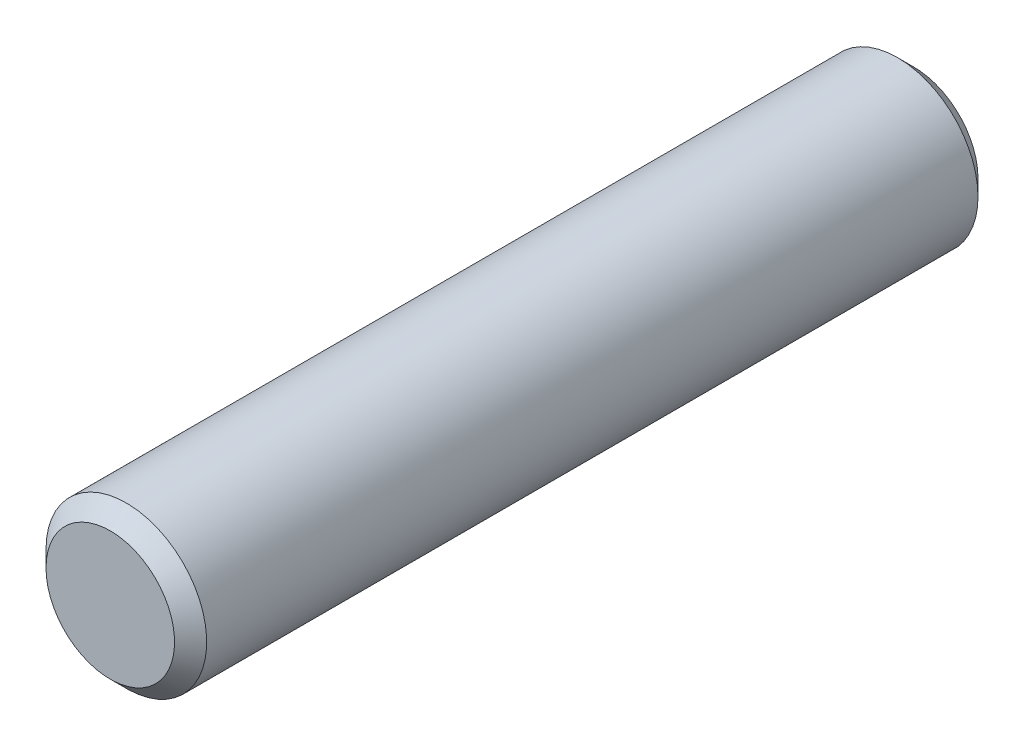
from build123d import *

# Parameters (mm, degrees)
ESQUISSE1_R          = 10
BASE_EXTRUSION_DEPTH = 100
CHANFREIN1_SIZE      = 2


with BuildPart() as part:
    # Esquisse1 → Base-Extrusion (new body)
    with BuildSketch(Plane.XY):
        with Locations(Location((0, 0, 0), (0, 0, 180))):
            Circle(ESQUISSE1_R)
    extrude(amount=BASE_EXTRUSION_DEPTH)

    # Chanfrein1
    chanfrein1_edges = [part.edges().sort_by_distance(p)[0] for p in [
        (10, 0, 0),
        (10, 0, 100),
    ]]
    chamfer(chanfrein1_edges, length=CHANFREIN1_SIZE)


solid = part.part
